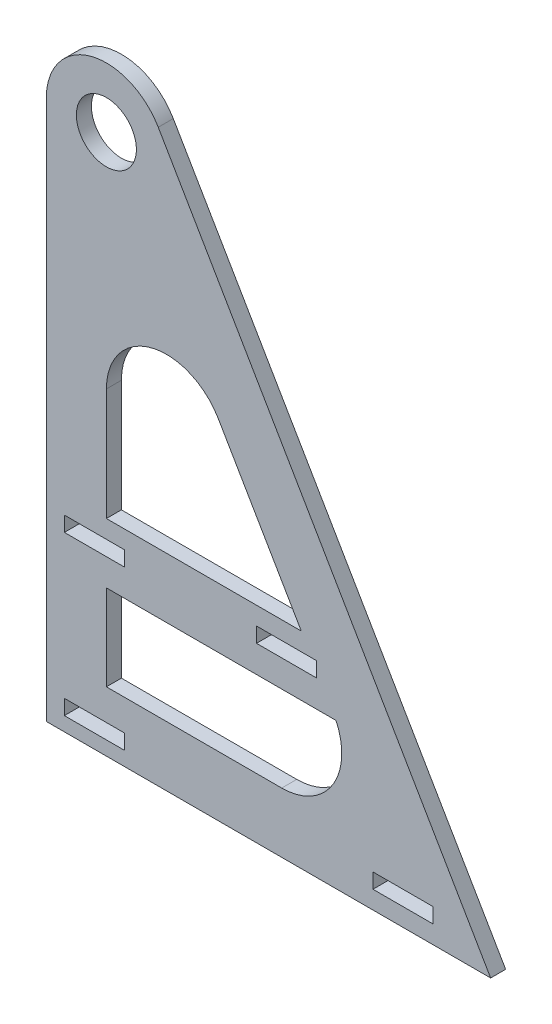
ISO-10303-21;
HEADER;
FILE_DESCRIPTION(('STEP AP214'),'2;1');
FILE_NAME('part.step','',(''),(''),'','','');
FILE_SCHEMA(('AUTOMOTIVE_DESIGN { 1 0 10303 214 1 1 1 1 }'));
ENDSEC;
DATA;
#1=APPLICATION_CONTEXT('core data for automotive mechanical design processes');
#2=APPLICATION_PROTOCOL_DEFINITION('international standard','automotive_design',2000,#1);
#3=PRODUCT_CONTEXT('',#1,'mechanical');
#4=PRODUCT('Part','Part','',(#3));
#5=PRODUCT_RELATED_PRODUCT_CATEGORY('part','',(#4));
#6=PRODUCT_DEFINITION_FORMATION('','',#4);
#7=PRODUCT_DEFINITION_CONTEXT('part definition',#1,'design');
#8=PRODUCT_DEFINITION('design','',#6,#7);
#9=PRODUCT_DEFINITION_SHAPE('','',#8);
#10=(LENGTH_UNIT() NAMED_UNIT(*) SI_UNIT(.MILLI.,.METRE.));
#11=(NAMED_UNIT(*) PLANE_ANGLE_UNIT() SI_UNIT($,.RADIAN.));
#12=(NAMED_UNIT(*) SI_UNIT($,.STERADIAN.) SOLID_ANGLE_UNIT());
#13=UNCERTAINTY_MEASURE_WITH_UNIT(LENGTH_MEASURE(1.E-05),#10,'distance_accuracy_value','');
#14=(GEOMETRIC_REPRESENTATION_CONTEXT(3) GLOBAL_UNCERTAINTY_ASSIGNED_CONTEXT((#13)) GLOBAL_UNIT_ASSIGNED_CONTEXT((#10,
#11,#12)) REPRESENTATION_CONTEXT('',''));
#15=CARTESIAN_POINT('',(0.,0.,0.));
#16=DIRECTION('',(0.,0.,1.));
#17=DIRECTION('',(1.,0.,0.));
#18=AXIS2_PLACEMENT_3D('',#15,#16,#17);
#19=CARTESIAN_POINT('',(0.,0.,12.5));
#20=DIRECTION('',(-1.,0.,0.));
#21=DIRECTION('',(0.,0.,1.));
#22=AXIS2_PLACEMENT_3D('',#19,#20,#21);
#23=PLANE('',#22);
#24=DIRECTION('',(0.,1.,0.));
#25=VECTOR('',#24,1.);
#26=CARTESIAN_POINT('',(0.,0.,0.));
#27=LINE('',#26,#25);
#28=CARTESIAN_POINT('',(0.,121.369897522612,0.));
#29=VERTEX_POINT('',#28);
#30=CARTESIAN_POINT('',(0.,214.831651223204,0.));
#31=VERTEX_POINT('',#30);
#32=EDGE_CURVE('E418',#29,#31,#27,.T.);
#33=ORIENTED_EDGE('',*,*,#32,.T.);
#34=DIRECTION('',(0.,0.,-1.));
#35=VECTOR('',#34,1.);
#36=CARTESIAN_POINT('',(0.,214.831651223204,12.5));
#37=LINE('',#36,#35);
#38=CARTESIAN_POINT('',(0.,214.831651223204,12.5));
#39=VERTEX_POINT('',#38);
#40=EDGE_CURVE('E11',#39,#31,#37,.T.);
#41=ORIENTED_EDGE('',*,*,#40,.F.);
#42=DIRECTION('',(0.,1.,0.));
#43=VECTOR('',#42,1.);
#44=CARTESIAN_POINT('',(0.,0.,12.5));
#45=LINE('',#44,#43);
#46=CARTESIAN_POINT('',(0.,121.369897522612,12.5));
#47=VERTEX_POINT('',#46);
#48=EDGE_CURVE('E381',#47,#39,#45,.T.);
#49=ORIENTED_EDGE('',*,*,#48,.F.);
#50=DIRECTION('',(0.,0.,-1.));
#51=VECTOR('',#50,1.);
#52=CARTESIAN_POINT('',(0.,121.369897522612,12.5));
#53=LINE('',#52,#51);
#54=EDGE_CURVE('E428',#47,#29,#53,.T.);
#55=ORIENTED_EDGE('',*,*,#54,.T.);
#56=EDGE_LOOP('',(#33,#41,#49,#55));
#57=FACE_BOUND('',#56,.T.);
#58=ADVANCED_FACE('F35',(#57),#23,.F.);
#59=CARTESIAN_POINT('',(50.,214.831651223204,12.5));
#60=DIRECTION('',(0.,0.,-1.));
#61=DIRECTION('',(-1.,0.,0.));
#62=AXIS2_PLACEMENT_3D('',#59,#60,#61);
#63=CYLINDRICAL_SURFACE('',#62,50.);
#64=CARTESIAN_POINT('',(50.,214.831651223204,0.));
#65=DIRECTION('',(0.,0.,1.));
#66=DIRECTION('',(1.,0.,0.));
#67=AXIS2_PLACEMENT_3D('',#64,#65,#66);
#68=CIRCLE('',#67,50.);
#69=CARTESIAN_POINT('',(93.2041796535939,239.999067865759,0.));
#70=VERTEX_POINT('',#69);
#71=EDGE_CURVE('E421',#31,#70,#68,.F.);
#72=ORIENTED_EDGE('',*,*,#71,.T.);
#73=DIRECTION('',(0.,0.,-1.));
#74=VECTOR('',#73,1.);
#75=CARTESIAN_POINT('',(93.2041796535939,239.999067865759,12.5));
#76=LINE('',#75,#74);
#77=CARTESIAN_POINT('',(93.2041796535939,239.999067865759,12.5));
#78=VERTEX_POINT('',#77);
#79=EDGE_CURVE('E44',#78,#70,#76,.T.);
#80=ORIENTED_EDGE('',*,*,#79,.F.);
#81=CARTESIAN_POINT('',(50.,214.831651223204,12.5));
#82=DIRECTION('',(0.,0.,1.));
#83=DIRECTION('',(1.,0.,0.));
#84=AXIS2_PLACEMENT_3D('',#81,#82,#83);
#85=CIRCLE('',#84,50.);
#86=EDGE_CURVE('E384',#39,#78,#85,.F.);
#87=ORIENTED_EDGE('',*,*,#86,.F.);
#88=ORIENTED_EDGE('',*,*,#40,.T.);
#89=EDGE_LOOP('',(#72,#80,#87,#88));
#90=FACE_BOUND('',#89,.T.);
#91=ADVANCED_FACE('F481',(#90),#63,.F.);
#92=CARTESIAN_POINT('',(173.974014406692,101.343817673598,12.5));
#93=DIRECTION('',(0.864083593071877,0.503348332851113,0.));
#94=DIRECTION('',(-0.503348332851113,0.864083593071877,0.));
#95=AXIS2_PLACEMENT_3D('',#92,#93,#94);
#96=PLANE('',#95);
#97=DIRECTION('',(0.503348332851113,-0.864083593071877,0.));
#98=VECTOR('',#97,1.);
#99=CARTESIAN_POINT('',(173.974014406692,101.343817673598,0.));
#100=LINE('',#99,#98);
#101=CARTESIAN_POINT('',(162.308367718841,121.369897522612,0.));
#102=VERTEX_POINT('',#101);
#103=EDGE_CURVE('E423',#70,#102,#100,.T.);
#104=ORIENTED_EDGE('',*,*,#103,.T.);
#105=DIRECTION('',(0.,0.,-1.));
#106=VECTOR('',#105,1.);
#107=CARTESIAN_POINT('',(162.308367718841,121.369897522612,12.5));
#108=LINE('',#107,#106);
#109=CARTESIAN_POINT('',(162.308367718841,121.369897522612,12.5));
#110=VERTEX_POINT('',#109);
#111=EDGE_CURVE('E430',#110,#102,#108,.T.);
#112=ORIENTED_EDGE('',*,*,#111,.F.);
#113=DIRECTION('',(0.503348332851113,-0.864083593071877,0.));
#114=VECTOR('',#113,1.);
#115=CARTESIAN_POINT('',(173.974014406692,101.343817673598,12.5));
#116=LINE('',#115,#114);
#117=EDGE_CURVE('E386',#78,#110,#116,.T.);
#118=ORIENTED_EDGE('',*,*,#117,.F.);
#119=ORIENTED_EDGE('',*,*,#79,.T.);
#120=EDGE_LOOP('',(#104,#112,#118,#119));
#121=FACE_BOUND('',#120,.T.);
#122=ADVANCED_FACE('F486',(#121),#96,.F.);
#123=CARTESIAN_POINT('',(0.,400.,12.5));
#124=DIRECTION('',(0.,0.,-1.));
#125=DIRECTION('',(-1.,0.,0.));
#126=AXIS2_PLACEMENT_3D('',#123,#124,#125);
#127=CYLINDRICAL_SURFACE('',#126,50.);
#128=CARTESIAN_POINT('',(0.,400.,0.));
#129=DIRECTION('',(0.,0.,1.));
#130=DIRECTION('',(1.,0.,0.));
#131=AXIS2_PLACEMENT_3D('',#128,#129,#130);
#132=CIRCLE('',#131,50.);
#133=CARTESIAN_POINT('',(-50.,400.,0.));
#134=VERTEX_POINT('',#133);
#135=CARTESIAN_POINT('',(43.2041796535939,425.167416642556,0.));
#136=VERTEX_POINT('',#135);
#137=EDGE_CURVE('E406',#134,#136,#132,.F.);
#138=ORIENTED_EDGE('',*,*,#137,.F.);
#139=DIRECTION('',(0.,0.,-1.));
#140=VECTOR('',#139,1.);
#141=CARTESIAN_POINT('',(-50.,400.,12.5));
#142=LINE('',#141,#140);
#143=CARTESIAN_POINT('',(-50.,400.,12.5));
#144=VERTEX_POINT('',#143);
#145=EDGE_CURVE('E431',#144,#134,#142,.T.);
#146=ORIENTED_EDGE('',*,*,#145,.F.);
#147=CARTESIAN_POINT('',(0.,400.,12.5));
#148=DIRECTION('',(0.,0.,1.));
#149=DIRECTION('',(1.,0.,0.));
#150=AXIS2_PLACEMENT_3D('',#147,#148,#149);
#151=CIRCLE('',#150,50.);
#152=CARTESIAN_POINT('',(43.2041796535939,425.167416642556,12.5));
#153=VERTEX_POINT('',#152);
#154=EDGE_CURVE('E370',#144,#153,#151,.F.);
#155=ORIENTED_EDGE('',*,*,#154,.T.);
#156=DIRECTION('',(0.,0.,-1.));
#157=VECTOR('',#156,1.);
#158=CARTESIAN_POINT('',(43.2041796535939,425.167416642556,12.5));
#159=LINE('',#158,#157);
#160=EDGE_CURVE('E435',#153,#136,#159,.T.);
#161=ORIENTED_EDGE('',*,*,#160,.T.);
#162=EDGE_LOOP('',(#138,#146,#155,#161));
#163=FACE_BOUND('',#162,.T.);
#164=ADVANCED_FACE('F521',(#163),#127,.T.);
#165=CARTESIAN_POINT('',(-49.9999999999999,0.,12.5));
#166=DIRECTION('',(1.,0.,0.));
#167=DIRECTION('',(0.,1.,0.));
#168=AXIS2_PLACEMENT_3D('',#165,#166,#167);
#169=PLANE('',#168);
#170=DIRECTION('',(0.,-1.,0.));
#171=VECTOR('',#170,1.);
#172=CARTESIAN_POINT('',(-49.9999999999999,0.,0.));
#173=LINE('',#172,#171);
#174=CARTESIAN_POINT('',(-49.9999999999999,-50.,0.));
#175=VERTEX_POINT('',#174);
#176=EDGE_CURVE('E409',#134,#175,#173,.T.);
#177=ORIENTED_EDGE('',*,*,#176,.T.);
#178=DIRECTION('',(0.,0.,-1.));
#179=VECTOR('',#178,1.);
#180=CARTESIAN_POINT('',(-49.9999999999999,-50.,12.5));
#181=LINE('',#180,#179);
#182=CARTESIAN_POINT('',(-49.9999999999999,-50.,12.5));
#183=VERTEX_POINT('',#182);
#184=EDGE_CURVE('E439',#183,#175,#181,.T.);
#185=ORIENTED_EDGE('',*,*,#184,.F.);
#186=DIRECTION('',(0.,-1.,0.));
#187=VECTOR('',#186,1.);
#188=CARTESIAN_POINT('',(-49.9999999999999,0.,12.5));
#189=LINE('',#188,#187);
#190=EDGE_CURVE('E373',#144,#183,#189,.T.);
#191=ORIENTED_EDGE('',*,*,#190,.F.);
#192=ORIENTED_EDGE('',*,*,#145,.T.);
#193=EDGE_LOOP('',(#177,#185,#191,#192));
#194=FACE_BOUND('',#193,.T.);
#195=ADVANCED_FACE('F517',(#194),#169,.F.);
#196=CARTESIAN_POINT('',(0.,-50.,12.5));
#197=DIRECTION('',(0.,1.,0.));
#198=DIRECTION('',(-1.,0.,0.));
#199=AXIS2_PLACEMENT_3D('',#196,#197,#198);
#200=PLANE('',#199);
#201=DIRECTION('',(1.,0.,0.));
#202=VECTOR('',#201,1.);
#203=CARTESIAN_POINT('',(0.,-50.,0.));
#204=LINE('',#203,#202);
#205=CARTESIAN_POINT('',(320.,-50.,0.));
#206=VERTEX_POINT('',#205);
#207=EDGE_CURVE('E412',#175,#206,#204,.T.);
#208=ORIENTED_EDGE('',*,*,#207,.T.);
#209=DIRECTION('',(0.,0.,-1.));
#210=VECTOR('',#209,1.);
#211=CARTESIAN_POINT('',(320.,-50.,12.5));
#212=LINE('',#211,#210);
#213=CARTESIAN_POINT('',(320.,-50.,12.5));
#214=VERTEX_POINT('',#213);
#215=EDGE_CURVE('E437',#214,#206,#212,.T.);
#216=ORIENTED_EDGE('',*,*,#215,.F.);
#217=DIRECTION('',(1.,0.,0.));
#218=VECTOR('',#217,1.);
#219=CARTESIAN_POINT('',(0.,-50.,12.5));
#220=LINE('',#219,#218);
#221=EDGE_CURVE('E376',#183,#214,#220,.T.);
#222=ORIENTED_EDGE('',*,*,#221,.F.);
#223=ORIENTED_EDGE('',*,*,#184,.T.);
#224=EDGE_LOOP('',(#208,#216,#222,#223));
#225=FACE_BOUND('',#224,.T.);
#226=ADVANCED_FACE('F514',(#225),#200,.F.);
#227=CARTESIAN_POINT('',(146.01818332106,50.,12.5));
#228=DIRECTION('',(0.,0.,-1.));
#229=DIRECTION('',(-1.,0.,0.));
#230=AXIS2_PLACEMENT_3D('',#227,#228,#229);
#231=CYLINDRICAL_SURFACE('',#230,50.);
#232=CARTESIAN_POINT('',(146.01818332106,50.,0.));
#233=DIRECTION('',(0.,0.,1.));
#234=DIRECTION('',(1.,0.,0.));
#235=AXIS2_PLACEMENT_3D('',#232,#233,#234);
#236=CIRCLE('',#235,50.);
#237=CARTESIAN_POINT('',(146.01818332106,0.,0.));
#238=VERTEX_POINT('',#237);
#239=CARTESIAN_POINT('',(191.22136329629,71.3698975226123,0.));
#240=VERTEX_POINT('',#239);
#241=EDGE_CURVE('E394',#238,#240,#236,.T.);
#242=ORIENTED_EDGE('',*,*,#241,.F.);
#243=DIRECTION('',(0.,0.,-1.));
#244=VECTOR('',#243,1.);
#245=CARTESIAN_POINT('',(146.01818332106,0.,12.5));
#246=LINE('',#245,#244);
#247=CARTESIAN_POINT('',(146.01818332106,0.,12.5));
#248=VERTEX_POINT('',#247);
#249=EDGE_CURVE('E39',#248,#238,#246,.T.);
#250=ORIENTED_EDGE('',*,*,#249,.F.);
#251=CARTESIAN_POINT('',(146.01818332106,50.,12.5));
#252=DIRECTION('',(0.,0.,1.));
#253=DIRECTION('',(1.,0.,0.));
#254=AXIS2_PLACEMENT_3D('',#251,#252,#253);
#255=CIRCLE('',#254,50.);
#256=CARTESIAN_POINT('',(191.22136329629,71.3698975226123,12.5));
#257=VERTEX_POINT('',#256);
#258=EDGE_CURVE('E358',#248,#257,#255,.T.);
#259=ORIENTED_EDGE('',*,*,#258,.T.);
#260=DIRECTION('',(0.,0.,-1.));
#261=VECTOR('',#260,1.);
#262=CARTESIAN_POINT('',(191.22136329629,71.3698975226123,12.5));
#263=LINE('',#262,#261);
#264=EDGE_CURVE('E391',#257,#240,#263,.T.);
#265=ORIENTED_EDGE('',*,*,#264,.T.);
#266=EDGE_LOOP('',(#242,#250,#259,#265));
#267=FACE_BOUND('',#266,.T.);
#268=ADVANCED_FACE('F457',(#267),#231,.F.);
#269=CARTESIAN_POINT('',(0.,0.,12.5));
#270=DIRECTION('',(0.,1.,0.));
#271=DIRECTION('',(0.,0.,1.));
#272=AXIS2_PLACEMENT_3D('',#269,#270,#271);
#273=PLANE('',#272);
#274=DIRECTION('',(1.,0.,0.));
#275=VECTOR('',#274,1.);
#276=CARTESIAN_POINT('',(0.,0.,0.));
#277=LINE('',#276,#275);
#278=CARTESIAN_POINT('',(0.,0.,0.));
#279=VERTEX_POINT('',#278);
#280=EDGE_CURVE('E397',#279,#238,#277,.T.);
#281=ORIENTED_EDGE('',*,*,#280,.F.);
#282=DIRECTION('',(0.,0.,-1.));
#283=VECTOR('',#282,1.);
#284=CARTESIAN_POINT('',(0.,0.,12.5));
#285=LINE('',#284,#283);
#286=CARTESIAN_POINT('',(0.,0.,12.5));
#287=VERTEX_POINT('',#286);
#288=EDGE_CURVE('E446',#287,#279,#285,.T.);
#289=ORIENTED_EDGE('',*,*,#288,.F.);
#290=DIRECTION('',(1.,0.,0.));
#291=VECTOR('',#290,1.);
#292=CARTESIAN_POINT('',(0.,0.,12.5));
#293=LINE('',#292,#291);
#294=EDGE_CURVE('E362',#287,#248,#293,.T.);
#295=ORIENTED_EDGE('',*,*,#294,.T.);
#296=ORIENTED_EDGE('',*,*,#249,.T.);
#297=EDGE_LOOP('',(#281,#289,#295,#296));
#298=FACE_BOUND('',#297,.T.);
#299=ADVANCED_FACE('F453',(#298),#273,.T.);
#300=CARTESIAN_POINT('',(0.,0.,12.5));
#301=DIRECTION('',(-1.,0.,0.));
#302=DIRECTION('',(0.,0.,1.));
#303=AXIS2_PLACEMENT_3D('',#300,#301,#302);
#304=PLANE('',#303);
#305=DIRECTION('',(0.,1.,0.));
#306=VECTOR('',#305,1.);
#307=CARTESIAN_POINT('',(0.,0.,0.));
#308=LINE('',#307,#306);
#309=CARTESIAN_POINT('',(0.,71.3698975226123,0.));
#310=VERTEX_POINT('',#309);
#311=EDGE_CURVE('E400',#279,#310,#308,.T.);
#312=ORIENTED_EDGE('',*,*,#311,.T.);
#313=DIRECTION('',(0.,0.,-1.));
#314=VECTOR('',#313,1.);
#315=CARTESIAN_POINT('',(0.,71.3698975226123,12.5));
#316=LINE('',#315,#314);
#317=CARTESIAN_POINT('',(0.,71.3698975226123,12.5));
#318=VERTEX_POINT('',#317);
#319=EDGE_CURVE('E444',#318,#310,#316,.T.);
#320=ORIENTED_EDGE('',*,*,#319,.F.);
#321=DIRECTION('',(0.,1.,0.));
#322=VECTOR('',#321,1.);
#323=CARTESIAN_POINT('',(0.,0.,12.5));
#324=LINE('',#323,#322);
#325=EDGE_CURVE('E365',#287,#318,#324,.T.);
#326=ORIENTED_EDGE('',*,*,#325,.F.);
#327=ORIENTED_EDGE('',*,*,#288,.T.);
#328=EDGE_LOOP('',(#312,#320,#326,#327));
#329=FACE_BOUND('',#328,.T.);
#330=ADVANCED_FACE('F463',(#329),#304,.F.);
#331=CARTESIAN_POINT('',(217.178194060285,126.511234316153,12.5));
#332=DIRECTION('',(0.864083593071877,0.503348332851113,0.));
#333=DIRECTION('',(-0.503348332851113,0.864083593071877,0.));
#334=AXIS2_PLACEMENT_3D('',#331,#332,#333);
#335=PLANE('',#334);
#336=DIRECTION('',(0.503348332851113,-0.864083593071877,0.));
#337=VECTOR('',#336,1.);
#338=CARTESIAN_POINT('',(217.178194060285,126.511234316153,0.));
#339=LINE('',#338,#337);
#340=EDGE_CURVE('E415',#136,#206,#339,.T.);
#341=ORIENTED_EDGE('',*,*,#340,.F.);
#342=ORIENTED_EDGE('',*,*,#160,.F.);
#343=DIRECTION('',(0.503348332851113,-0.864083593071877,0.));
#344=VECTOR('',#343,1.);
#345=CARTESIAN_POINT('',(217.178194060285,126.511234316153,12.5));
#346=LINE('',#345,#344);
#347=EDGE_CURVE('E378',#153,#214,#346,.T.);
#348=ORIENTED_EDGE('',*,*,#347,.T.);
#349=ORIENTED_EDGE('',*,*,#215,.T.);
#350=EDGE_LOOP('',(#341,#342,#348,#349));
#351=FACE_BOUND('',#350,.T.);
#352=ADVANCED_FACE('F510',(#351),#335,.T.);
#353=CARTESIAN_POINT('',(0.,71.3698975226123,12.5));
#354=DIRECTION('',(0.,1.,0.));
#355=DIRECTION('',(0.,0.,1.));
#356=AXIS2_PLACEMENT_3D('',#353,#354,#355);
#357=PLANE('',#356);
#358=DIRECTION('',(1.,0.,0.));
#359=VECTOR('',#358,1.);
#360=CARTESIAN_POINT('',(0.,71.3698975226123,0.));
#361=LINE('',#360,#359);
#362=EDGE_CURVE('E403',#310,#240,#361,.T.);
#363=ORIENTED_EDGE('',*,*,#362,.T.);
#364=ORIENTED_EDGE('',*,*,#264,.F.);
#365=DIRECTION('',(1.,0.,0.));
#366=VECTOR('',#365,1.);
#367=CARTESIAN_POINT('',(0.,71.3698975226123,12.5));
#368=LINE('',#367,#366);
#369=EDGE_CURVE('E368',#318,#257,#368,.T.);
#370=ORIENTED_EDGE('',*,*,#369,.F.);
#371=ORIENTED_EDGE('',*,*,#319,.T.);
#372=EDGE_LOOP('',(#363,#364,#370,#371));
#373=FACE_BOUND('',#372,.T.);
#374=ADVANCED_FACE('F465',(#373),#357,.F.);
#375=CARTESIAN_POINT('',(0.,400.,12.5));
#376=DIRECTION('',(0.,0.,-1.));
#377=DIRECTION('',(-1.,0.,0.));
#378=AXIS2_PLACEMENT_3D('',#375,#376,#377);
#379=CYLINDRICAL_SURFACE('',#378,25.);
#380=CARTESIAN_POINT('',(0.,400.,12.5));
#381=DIRECTION('',(0.,0.,1.));
#382=DIRECTION('',(1.,0.,0.));
#383=AXIS2_PLACEMENT_3D('',#380,#381,#382);
#384=CIRCLE('',#383,25.);
#385=CARTESIAN_POINT('',(25.,400.,12.5));
#386=VERTEX_POINT('',#385);
#387=EDGE_CURVE('E355',#386,#386,#384,.T.);
#388=ORIENTED_EDGE('',*,*,#387,.T.);
#389=EDGE_LOOP('',(#388));
#390=FACE_BOUND('',#389,.T.);
#391=CARTESIAN_POINT('',(0.,400.,0.));
#392=DIRECTION('',(0.,0.,1.));
#393=DIRECTION('',(1.,0.,0.));
#394=AXIS2_PLACEMENT_3D('',#391,#392,#393);
#395=CIRCLE('',#394,25.);
#396=CARTESIAN_POINT('',(25.,400.,0.));
#397=VERTEX_POINT('',#396);
#398=EDGE_CURVE('E348',#397,#397,#395,.T.);
#399=ORIENTED_EDGE('',*,*,#398,.F.);
#400=EDGE_LOOP('',(#399));
#401=FACE_BOUND('',#400,.T.);
#402=ADVANCED_FACE('F37',(#390,#401),#379,.F.);
#403=CARTESIAN_POINT('',(0.,121.369897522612,12.5));
#404=DIRECTION('',(0.,1.,0.));
#405=DIRECTION('',(0.,0.,1.));
#406=AXIS2_PLACEMENT_3D('',#403,#404,#405);
#407=PLANE('',#406);
#408=DIRECTION('',(1.,0.,0.));
#409=VECTOR('',#408,1.);
#410=CARTESIAN_POINT('',(0.,121.369897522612,0.));
#411=LINE('',#410,#409);
#412=EDGE_CURVE('E359',#29,#102,#411,.T.);
#413=ORIENTED_EDGE('',*,*,#412,.F.);
#414=ORIENTED_EDGE('',*,*,#54,.F.);
#415=DIRECTION('',(1.,0.,0.));
#416=VECTOR('',#415,1.);
#417=CARTESIAN_POINT('',(0.,121.369897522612,12.5));
#418=LINE('',#417,#416);
#419=EDGE_CURVE('E388',#47,#110,#418,.T.);
#420=ORIENTED_EDGE('',*,*,#419,.T.);
#421=ORIENTED_EDGE('',*,*,#111,.T.);
#422=EDGE_LOOP('',(#413,#414,#420,#421));
#423=FACE_BOUND('',#422,.T.);
#424=ADVANCED_FACE('F469',(#423),#407,.T.);
#425=CARTESIAN_POINT('',(0.,0.,12.5));
#426=DIRECTION('',(0.,0.,1.));
#427=DIRECTION('',(1.,0.,0.));
#428=AXIS2_PLACEMENT_3D('',#425,#426,#427);
#429=PLANE('',#428);
#430=DIRECTION('',(0.,1.,0.));
#431=VECTOR('',#430,1.);
#432=CARTESIAN_POINT('',(-35.,-25.7737408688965,12.5));
#433=LINE('',#432,#431);
#434=CARTESIAN_POINT('',(-35.,-38.2737408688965,12.5));
#435=VERTEX_POINT('',#434);
#436=CARTESIAN_POINT('',(-35.,-25.7737408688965,12.5));
#437=VERTEX_POINT('',#436);
#438=EDGE_CURVE('E224',#435,#437,#433,.T.);
#439=ORIENTED_EDGE('',*,*,#438,.T.);
#440=DIRECTION('',(1.,0.,0.));
#441=VECTOR('',#440,1.);
#442=CARTESIAN_POINT('',(-35.,-25.7737408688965,12.5));
#443=LINE('',#442,#441);
#444=CARTESIAN_POINT('',(15.,-25.7737408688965,12.5));
#445=VERTEX_POINT('',#444);
#446=EDGE_CURVE('E233',#437,#445,#443,.T.);
#447=ORIENTED_EDGE('',*,*,#446,.T.);
#448=DIRECTION('',(0.,-1.,0.));
#449=VECTOR('',#448,1.);
#450=CARTESIAN_POINT('',(15.,-25.7737408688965,12.5));
#451=LINE('',#450,#449);
#452=CARTESIAN_POINT('',(15.,-38.2737408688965,12.5));
#453=VERTEX_POINT('',#452);
#454=EDGE_CURVE('E52',#445,#453,#451,.T.);
#455=ORIENTED_EDGE('',*,*,#454,.T.);
#456=DIRECTION('',(-1.,0.,0.));
#457=VECTOR('',#456,1.);
#458=CARTESIAN_POINT('',(-35.,-38.2737408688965,12.5));
#459=LINE('',#458,#457);
#460=EDGE_CURVE('E230',#453,#435,#459,.T.);
#461=ORIENTED_EDGE('',*,*,#460,.T.);
#462=EDGE_LOOP('',(#439,#447,#455,#461));
#463=FACE_BOUND('',#462,.T.);
#464=DIRECTION('',(0.,-1.,0.));
#465=VECTOR('',#464,1.);
#466=CARTESIAN_POINT('',(272.,-22.5,12.5));
#467=LINE('',#466,#465);
#468=CARTESIAN_POINT('',(272.,-22.5,12.5));
#469=VERTEX_POINT('',#468);
#470=CARTESIAN_POINT('',(272.,-35.,12.5));
#471=VERTEX_POINT('',#470);
#472=EDGE_CURVE('E259',#469,#471,#467,.T.);
#473=ORIENTED_EDGE('',*,*,#472,.T.);
#474=DIRECTION('',(-1.,0.,0.));
#475=VECTOR('',#474,1.);
#476=CARTESIAN_POINT('',(272.,-35.,12.5));
#477=LINE('',#476,#475);
#478=CARTESIAN_POINT('',(222.,-35.,12.5));
#479=VERTEX_POINT('',#478);
#480=EDGE_CURVE('E262',#471,#479,#477,.T.);
#481=ORIENTED_EDGE('',*,*,#480,.T.);
#482=DIRECTION('',(0.,1.,0.));
#483=VECTOR('',#482,1.);
#484=CARTESIAN_POINT('',(222.,-22.5,12.5));
#485=LINE('',#484,#483);
#486=CARTESIAN_POINT('',(222.,-22.5,12.5));
#487=VERTEX_POINT('',#486);
#488=EDGE_CURVE('E266',#479,#487,#485,.T.);
#489=ORIENTED_EDGE('',*,*,#488,.T.);
#490=DIRECTION('',(1.,0.,0.));
#491=VECTOR('',#490,1.);
#492=CARTESIAN_POINT('',(272.,-22.5,12.5));
#493=LINE('',#492,#491);
#494=EDGE_CURVE('E269',#487,#469,#493,.T.);
#495=ORIENTED_EDGE('',*,*,#494,.T.);
#496=EDGE_LOOP('',(#473,#481,#489,#495));
#497=FACE_BOUND('',#496,.T.);
#498=DIRECTION('',(0.,1.,0.));
#499=VECTOR('',#498,1.);
#500=CARTESIAN_POINT('',(15.,106.369897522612,12.5));
#501=LINE('',#500,#499);
#502=CARTESIAN_POINT('',(15.,93.8698975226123,12.5));
#503=VERTEX_POINT('',#502);
#504=CARTESIAN_POINT('',(15.,106.369897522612,12.5));
#505=VERTEX_POINT('',#504);
#506=EDGE_CURVE('E284',#503,#505,#501,.T.);
#507=ORIENTED_EDGE('',*,*,#506,.F.);
#508=DIRECTION('',(1.,0.,0.));
#509=VECTOR('',#508,1.);
#510=CARTESIAN_POINT('',(15.,93.8698975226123,12.5));
#511=LINE('',#510,#509);
#512=CARTESIAN_POINT('',(-35.,93.8698975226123,12.5));
#513=VERTEX_POINT('',#512);
#514=EDGE_CURVE('E295',#513,#503,#511,.T.);
#515=ORIENTED_EDGE('',*,*,#514,.F.);
#516=DIRECTION('',(0.,-1.,0.));
#517=VECTOR('',#516,1.);
#518=CARTESIAN_POINT('',(-35.,106.369897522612,12.5));
#519=LINE('',#518,#517);
#520=CARTESIAN_POINT('',(-35.,106.369897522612,12.5));
#521=VERTEX_POINT('',#520);
#522=EDGE_CURVE('E309',#521,#513,#519,.T.);
#523=ORIENTED_EDGE('',*,*,#522,.F.);
#524=DIRECTION('',(-1.,0.,0.));
#525=VECTOR('',#524,1.);
#526=CARTESIAN_POINT('',(15.,106.369897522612,12.5));
#527=LINE('',#526,#525);
#528=EDGE_CURVE('E306',#505,#521,#527,.T.);
#529=ORIENTED_EDGE('',*,*,#528,.F.);
#530=EDGE_LOOP('',(#507,#515,#523,#529));
#531=FACE_BOUND('',#530,.T.);
#532=DIRECTION('',(0.,1.,0.));
#533=VECTOR('',#532,1.);
#534=CARTESIAN_POINT('',(175.,106.369897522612,12.5));
#535=LINE('',#534,#533);
#536=CARTESIAN_POINT('',(175.,93.8698975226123,12.5));
#537=VERTEX_POINT('',#536);
#538=CARTESIAN_POINT('',(175.,106.369897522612,12.5));
#539=VERTEX_POINT('',#538);
#540=EDGE_CURVE('E316',#537,#539,#535,.T.);
#541=ORIENTED_EDGE('',*,*,#540,.F.);
#542=DIRECTION('',(1.,0.,0.));
#543=VECTOR('',#542,1.);
#544=CARTESIAN_POINT('',(175.,93.8698975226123,12.5));
#545=LINE('',#544,#543);
#546=CARTESIAN_POINT('',(125.,93.8698975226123,12.5));
#547=VERTEX_POINT('',#546);
#548=EDGE_CURVE('E327',#547,#537,#545,.T.);
#549=ORIENTED_EDGE('',*,*,#548,.F.);
#550=DIRECTION('',(0.,-1.,0.));
#551=VECTOR('',#550,1.);
#552=CARTESIAN_POINT('',(125.,106.369897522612,12.5));
#553=LINE('',#552,#551);
#554=CARTESIAN_POINT('',(125.,106.369897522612,12.5));
#555=VERTEX_POINT('',#554);
#556=EDGE_CURVE('E341',#555,#547,#553,.T.);
#557=ORIENTED_EDGE('',*,*,#556,.F.);
#558=DIRECTION('',(-1.,0.,0.));
#559=VECTOR('',#558,1.);
#560=CARTESIAN_POINT('',(175.,106.369897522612,12.5));
#561=LINE('',#560,#559);
#562=EDGE_CURVE('E338',#539,#555,#561,.T.);
#563=ORIENTED_EDGE('',*,*,#562,.F.);
#564=EDGE_LOOP('',(#541,#549,#557,#563));
#565=FACE_BOUND('',#564,.T.);
#566=ORIENTED_EDGE('',*,*,#387,.F.);
#567=EDGE_LOOP('',(#566));
#568=FACE_BOUND('',#567,.T.);
#569=ORIENTED_EDGE('',*,*,#258,.F.);
#570=ORIENTED_EDGE('',*,*,#294,.F.);
#571=ORIENTED_EDGE('',*,*,#325,.T.);
#572=ORIENTED_EDGE('',*,*,#369,.T.);
#573=EDGE_LOOP('',(#569,#570,#571,#572));
#574=FACE_BOUND('',#573,.T.);
#575=ORIENTED_EDGE('',*,*,#154,.F.);
#576=ORIENTED_EDGE('',*,*,#190,.T.);
#577=ORIENTED_EDGE('',*,*,#221,.T.);
#578=ORIENTED_EDGE('',*,*,#347,.F.);
#579=EDGE_LOOP('',(#575,#576,#577,#578));
#580=FACE_BOUND('',#579,.T.);
#581=ORIENTED_EDGE('',*,*,#48,.T.);
#582=ORIENTED_EDGE('',*,*,#86,.T.);
#583=ORIENTED_EDGE('',*,*,#117,.T.);
#584=ORIENTED_EDGE('',*,*,#419,.F.);
#585=EDGE_LOOP('',(#581,#582,#583,#584));
#586=FACE_BOUND('',#585,.T.);
#587=ADVANCED_FACE('F237',(#463,#497,#531,#565,#568,#574,#580,#586),#429,.T.);
#588=CARTESIAN_POINT('',(0.,0.,0.));
#589=DIRECTION('',(0.,0.,1.));
#590=DIRECTION('',(1.,0.,0.));
#591=AXIS2_PLACEMENT_3D('',#588,#589,#590);
#592=PLANE('',#591);
#593=DIRECTION('',(1.,0.,0.));
#594=VECTOR('',#593,1.);
#595=CARTESIAN_POINT('',(-35.,-25.7737408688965,0.));
#596=LINE('',#595,#594);
#597=CARTESIAN_POINT('',(-35.,-25.7737408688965,0.));
#598=VERTEX_POINT('',#597);
#599=CARTESIAN_POINT('',(15.,-25.7737408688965,0.));
#600=VERTEX_POINT('',#599);
#601=EDGE_CURVE('E249',#598,#600,#596,.T.);
#602=ORIENTED_EDGE('',*,*,#601,.F.);
#603=DIRECTION('',(0.,1.,0.));
#604=VECTOR('',#603,1.);
#605=CARTESIAN_POINT('',(-35.,-25.7737408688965,0.));
#606=LINE('',#605,#604);
#607=CARTESIAN_POINT('',(-35.,-38.2737408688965,0.));
#608=VERTEX_POINT('',#607);
#609=EDGE_CURVE('E60',#608,#598,#606,.T.);
#610=ORIENTED_EDGE('',*,*,#609,.F.);
#611=DIRECTION('',(-1.,0.,0.));
#612=VECTOR('',#611,1.);
#613=CARTESIAN_POINT('',(-35.,-38.2737408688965,0.));
#614=LINE('',#613,#612);
#615=CARTESIAN_POINT('',(15.,-38.2737408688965,0.));
#616=VERTEX_POINT('',#615);
#617=EDGE_CURVE('E240',#616,#608,#614,.T.);
#618=ORIENTED_EDGE('',*,*,#617,.F.);
#619=DIRECTION('',(0.,-1.,0.));
#620=VECTOR('',#619,1.);
#621=CARTESIAN_POINT('',(15.,-25.7737408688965,0.));
#622=LINE('',#621,#620);
#623=EDGE_CURVE('E243',#600,#616,#622,.T.);
#624=ORIENTED_EDGE('',*,*,#623,.F.);
#625=EDGE_LOOP('',(#602,#610,#618,#624));
#626=FACE_BOUND('',#625,.T.);
#627=DIRECTION('',(-1.,0.,0.));
#628=VECTOR('',#627,1.);
#629=CARTESIAN_POINT('',(272.,-35.,0.));
#630=LINE('',#629,#628);
#631=CARTESIAN_POINT('',(272.,-35.,0.));
#632=VERTEX_POINT('',#631);
#633=CARTESIAN_POINT('',(222.,-35.,0.));
#634=VERTEX_POINT('',#633);
#635=EDGE_CURVE('E274',#632,#634,#630,.T.);
#636=ORIENTED_EDGE('',*,*,#635,.F.);
#637=DIRECTION('',(0.,-1.,0.));
#638=VECTOR('',#637,1.);
#639=CARTESIAN_POINT('',(272.,-22.5,0.));
#640=LINE('',#639,#638);
#641=CARTESIAN_POINT('',(272.,-22.5,0.));
#642=VERTEX_POINT('',#641);
#643=EDGE_CURVE('E255',#642,#632,#640,.T.);
#644=ORIENTED_EDGE('',*,*,#643,.F.);
#645=DIRECTION('',(1.,0.,0.));
#646=VECTOR('',#645,1.);
#647=CARTESIAN_POINT('',(272.,-22.5,0.));
#648=LINE('',#647,#646);
#649=CARTESIAN_POINT('',(222.,-22.5,0.));
#650=VERTEX_POINT('',#649);
#651=EDGE_CURVE('E263',#650,#642,#648,.T.);
#652=ORIENTED_EDGE('',*,*,#651,.F.);
#653=DIRECTION('',(0.,1.,0.));
#654=VECTOR('',#653,1.);
#655=CARTESIAN_POINT('',(222.,-22.5,0.));
#656=LINE('',#655,#654);
#657=EDGE_CURVE('E277',#634,#650,#656,.T.);
#658=ORIENTED_EDGE('',*,*,#657,.F.);
#659=EDGE_LOOP('',(#636,#644,#652,#658));
#660=FACE_BOUND('',#659,.T.);
#661=DIRECTION('',(1.,0.,0.));
#662=VECTOR('',#661,1.);
#663=CARTESIAN_POINT('',(15.,93.8698975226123,0.));
#664=LINE('',#663,#662);
#665=CARTESIAN_POINT('',(-35.,93.8698975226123,0.));
#666=VERTEX_POINT('',#665);
#667=CARTESIAN_POINT('',(15.,93.8698975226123,0.));
#668=VERTEX_POINT('',#667);
#669=EDGE_CURVE('E301',#666,#668,#664,.T.);
#670=ORIENTED_EDGE('',*,*,#669,.T.);
#671=DIRECTION('',(0.,1.,0.));
#672=VECTOR('',#671,1.);
#673=CARTESIAN_POINT('',(15.,106.369897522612,0.));
#674=LINE('',#673,#672);
#675=CARTESIAN_POINT('',(15.,106.369897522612,0.));
#676=VERTEX_POINT('',#675);
#677=EDGE_CURVE('E291',#668,#676,#674,.T.);
#678=ORIENTED_EDGE('',*,*,#677,.T.);
#679=DIRECTION('',(-1.,0.,0.));
#680=VECTOR('',#679,1.);
#681=CARTESIAN_POINT('',(15.,106.369897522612,0.));
#682=LINE('',#681,#680);
#683=CARTESIAN_POINT('',(-35.,106.369897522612,0.));
#684=VERTEX_POINT('',#683);
#685=EDGE_CURVE('E294',#676,#684,#682,.T.);
#686=ORIENTED_EDGE('',*,*,#685,.T.);
#687=DIRECTION('',(0.,-1.,0.));
#688=VECTOR('',#687,1.);
#689=CARTESIAN_POINT('',(-35.,106.369897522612,0.));
#690=LINE('',#689,#688);
#691=EDGE_CURVE('E298',#684,#666,#690,.T.);
#692=ORIENTED_EDGE('',*,*,#691,.T.);
#693=EDGE_LOOP('',(#670,#678,#686,#692));
#694=FACE_BOUND('',#693,.T.);
#695=DIRECTION('',(1.,0.,0.));
#696=VECTOR('',#695,1.);
#697=CARTESIAN_POINT('',(175.,93.8698975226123,0.));
#698=LINE('',#697,#696);
#699=CARTESIAN_POINT('',(125.,93.8698975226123,0.));
#700=VERTEX_POINT('',#699);
#701=CARTESIAN_POINT('',(175.,93.8698975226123,0.));
#702=VERTEX_POINT('',#701);
#703=EDGE_CURVE('E333',#700,#702,#698,.T.);
#704=ORIENTED_EDGE('',*,*,#703,.T.);
#705=DIRECTION('',(0.,1.,0.));
#706=VECTOR('',#705,1.);
#707=CARTESIAN_POINT('',(175.,106.369897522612,0.));
#708=LINE('',#707,#706);
#709=CARTESIAN_POINT('',(175.,106.369897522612,0.));
#710=VERTEX_POINT('',#709);
#711=EDGE_CURVE('E323',#702,#710,#708,.T.);
#712=ORIENTED_EDGE('',*,*,#711,.T.);
#713=DIRECTION('',(-1.,0.,0.));
#714=VECTOR('',#713,1.);
#715=CARTESIAN_POINT('',(175.,106.369897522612,0.));
#716=LINE('',#715,#714);
#717=CARTESIAN_POINT('',(125.,106.369897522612,0.));
#718=VERTEX_POINT('',#717);
#719=EDGE_CURVE('E326',#710,#718,#716,.T.);
#720=ORIENTED_EDGE('',*,*,#719,.T.);
#721=DIRECTION('',(0.,-1.,0.));
#722=VECTOR('',#721,1.);
#723=CARTESIAN_POINT('',(125.,106.369897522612,0.));
#724=LINE('',#723,#722);
#725=EDGE_CURVE('E330',#718,#700,#724,.T.);
#726=ORIENTED_EDGE('',*,*,#725,.T.);
#727=EDGE_LOOP('',(#704,#712,#720,#726));
#728=FACE_BOUND('',#727,.T.);
#729=ORIENTED_EDGE('',*,*,#398,.T.);
#730=EDGE_LOOP('',(#729));
#731=FACE_BOUND('',#730,.T.);
#732=ORIENTED_EDGE('',*,*,#241,.T.);
#733=ORIENTED_EDGE('',*,*,#362,.F.);
#734=ORIENTED_EDGE('',*,*,#311,.F.);
#735=ORIENTED_EDGE('',*,*,#280,.T.);
#736=EDGE_LOOP('',(#732,#733,#734,#735));
#737=FACE_BOUND('',#736,.T.);
#738=ORIENTED_EDGE('',*,*,#137,.T.);
#739=ORIENTED_EDGE('',*,*,#340,.T.);
#740=ORIENTED_EDGE('',*,*,#207,.F.);
#741=ORIENTED_EDGE('',*,*,#176,.F.);
#742=EDGE_LOOP('',(#738,#739,#740,#741));
#743=FACE_BOUND('',#742,.T.);
#744=ORIENTED_EDGE('',*,*,#32,.F.);
#745=ORIENTED_EDGE('',*,*,#412,.T.);
#746=ORIENTED_EDGE('',*,*,#103,.F.);
#747=ORIENTED_EDGE('',*,*,#71,.F.);
#748=EDGE_LOOP('',(#744,#745,#746,#747));
#749=FACE_BOUND('',#748,.T.);
#750=ADVANCED_FACE('F460',(#626,#660,#694,#728,#731,#737,#743,#749),#592,.F.);
#751=CARTESIAN_POINT('',(175.,106.369897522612,0.));
#752=DIRECTION('',(1.,0.,0.));
#753=DIRECTION('',(0.,0.,-1.));
#754=AXIS2_PLACEMENT_3D('',#751,#752,#753);
#755=PLANE('',#754);
#756=ORIENTED_EDGE('',*,*,#540,.T.);
#757=DIRECTION('',(0.,0.,1.));
#758=VECTOR('',#757,1.);
#759=CARTESIAN_POINT('',(175.,106.369897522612,0.));
#760=LINE('',#759,#758);
#761=EDGE_CURVE('E336',#710,#539,#760,.T.);
#762=ORIENTED_EDGE('',*,*,#761,.F.);
#763=ORIENTED_EDGE('',*,*,#711,.F.);
#764=DIRECTION('',(0.,0.,1.));
#765=VECTOR('',#764,1.);
#766=CARTESIAN_POINT('',(175.,93.8698975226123,0.));
#767=LINE('',#766,#765);
#768=EDGE_CURVE('E346',#702,#537,#767,.T.);
#769=ORIENTED_EDGE('',*,*,#768,.T.);
#770=EDGE_LOOP('',(#756,#762,#763,#769));
#771=FACE_BOUND('',#770,.T.);
#772=ADVANCED_FACE('F491',(#771),#755,.F.);
#773=CARTESIAN_POINT('',(175.,93.8698975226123,0.));
#774=DIRECTION('',(0.,-1.,0.));
#775=DIRECTION('',(0.,0.,-1.));
#776=AXIS2_PLACEMENT_3D('',#773,#774,#775);
#777=PLANE('',#776);
#778=ORIENTED_EDGE('',*,*,#548,.T.);
#779=ORIENTED_EDGE('',*,*,#768,.F.);
#780=ORIENTED_EDGE('',*,*,#703,.F.);
#781=DIRECTION('',(0.,0.,1.));
#782=VECTOR('',#781,1.);
#783=CARTESIAN_POINT('',(125.,93.8698975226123,0.));
#784=LINE('',#783,#782);
#785=EDGE_CURVE('E349',#700,#547,#784,.T.);
#786=ORIENTED_EDGE('',*,*,#785,.T.);
#787=EDGE_LOOP('',(#778,#779,#780,#786));
#788=FACE_BOUND('',#787,.T.);
#789=ADVANCED_FACE('F497',(#788),#777,.F.);
#790=CARTESIAN_POINT('',(125.,106.369897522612,0.));
#791=DIRECTION('',(-1.,0.,0.));
#792=DIRECTION('',(0.,-1.,0.));
#793=AXIS2_PLACEMENT_3D('',#790,#791,#792);
#794=PLANE('',#793);
#795=ORIENTED_EDGE('',*,*,#556,.T.);
#796=ORIENTED_EDGE('',*,*,#785,.F.);
#797=ORIENTED_EDGE('',*,*,#725,.F.);
#798=DIRECTION('',(0.,0.,1.));
#799=VECTOR('',#798,1.);
#800=CARTESIAN_POINT('',(125.,106.369897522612,0.));
#801=LINE('',#800,#799);
#802=EDGE_CURVE('E351',#718,#555,#801,.T.);
#803=ORIENTED_EDGE('',*,*,#802,.T.);
#804=EDGE_LOOP('',(#795,#796,#797,#803));
#805=FACE_BOUND('',#804,.T.);
#806=ADVANCED_FACE('F652',(#805),#794,.F.);
#807=CARTESIAN_POINT('',(175.,106.369897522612,0.));
#808=DIRECTION('',(0.,1.,0.));
#809=DIRECTION('',(0.,0.,1.));
#810=AXIS2_PLACEMENT_3D('',#807,#808,#809);
#811=PLANE('',#810);
#812=ORIENTED_EDGE('',*,*,#562,.T.);
#813=ORIENTED_EDGE('',*,*,#802,.F.);
#814=ORIENTED_EDGE('',*,*,#719,.F.);
#815=ORIENTED_EDGE('',*,*,#761,.T.);
#816=EDGE_LOOP('',(#812,#813,#814,#815));
#817=FACE_BOUND('',#816,.T.);
#818=ADVANCED_FACE('F648',(#817),#811,.F.);
#819=CARTESIAN_POINT('',(15.,106.369897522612,0.));
#820=DIRECTION('',(1.,0.,0.));
#821=DIRECTION('',(0.,1.,0.));
#822=AXIS2_PLACEMENT_3D('',#819,#820,#821);
#823=PLANE('',#822);
#824=ORIENTED_EDGE('',*,*,#506,.T.);
#825=DIRECTION('',(0.,0.,1.));
#826=VECTOR('',#825,1.);
#827=CARTESIAN_POINT('',(15.,106.369897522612,0.));
#828=LINE('',#827,#826);
#829=EDGE_CURVE('E304',#676,#505,#828,.T.);
#830=ORIENTED_EDGE('',*,*,#829,.F.);
#831=ORIENTED_EDGE('',*,*,#677,.F.);
#832=DIRECTION('',(0.,0.,1.));
#833=VECTOR('',#832,1.);
#834=CARTESIAN_POINT('',(15.,93.8698975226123,0.));
#835=LINE('',#834,#833);
#836=EDGE_CURVE('E314',#668,#503,#835,.T.);
#837=ORIENTED_EDGE('',*,*,#836,.T.);
#838=EDGE_LOOP('',(#824,#830,#831,#837));
#839=FACE_BOUND('',#838,.T.);
#840=ADVANCED_FACE('F638',(#839),#823,.F.);
#841=CARTESIAN_POINT('',(15.,93.8698975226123,0.));
#842=DIRECTION('',(0.,-1.,0.));
#843=DIRECTION('',(0.,0.,-1.));
#844=AXIS2_PLACEMENT_3D('',#841,#842,#843);
#845=PLANE('',#844);
#846=ORIENTED_EDGE('',*,*,#514,.T.);
#847=ORIENTED_EDGE('',*,*,#836,.F.);
#848=ORIENTED_EDGE('',*,*,#669,.F.);
#849=DIRECTION('',(0.,0.,1.));
#850=VECTOR('',#849,1.);
#851=CARTESIAN_POINT('',(-35.,93.8698975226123,0.));
#852=LINE('',#851,#850);
#853=EDGE_CURVE('E317',#666,#513,#852,.T.);
#854=ORIENTED_EDGE('',*,*,#853,.T.);
#855=EDGE_LOOP('',(#846,#847,#848,#854));
#856=FACE_BOUND('',#855,.T.);
#857=ADVANCED_FACE('F634',(#856),#845,.F.);
#858=CARTESIAN_POINT('',(-35.,106.369897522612,0.));
#859=DIRECTION('',(-1.,0.,0.));
#860=DIRECTION('',(0.,0.,1.));
#861=AXIS2_PLACEMENT_3D('',#858,#859,#860);
#862=PLANE('',#861);
#863=ORIENTED_EDGE('',*,*,#522,.T.);
#864=ORIENTED_EDGE('',*,*,#853,.F.);
#865=ORIENTED_EDGE('',*,*,#691,.F.);
#866=DIRECTION('',(0.,0.,1.));
#867=VECTOR('',#866,1.);
#868=CARTESIAN_POINT('',(-35.,106.369897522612,0.));
#869=LINE('',#868,#867);
#870=EDGE_CURVE('E319',#684,#521,#869,.T.);
#871=ORIENTED_EDGE('',*,*,#870,.T.);
#872=EDGE_LOOP('',(#863,#864,#865,#871));
#873=FACE_BOUND('',#872,.T.);
#874=ADVANCED_FACE('F637',(#873),#862,.F.);
#875=CARTESIAN_POINT('',(15.,106.369897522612,0.));
#876=DIRECTION('',(0.,1.,0.));
#877=DIRECTION('',(0.,0.,1.));
#878=AXIS2_PLACEMENT_3D('',#875,#876,#877);
#879=PLANE('',#878);
#880=ORIENTED_EDGE('',*,*,#528,.T.);
#881=ORIENTED_EDGE('',*,*,#870,.F.);
#882=ORIENTED_EDGE('',*,*,#685,.F.);
#883=ORIENTED_EDGE('',*,*,#829,.T.);
#884=EDGE_LOOP('',(#880,#881,#882,#883));
#885=FACE_BOUND('',#884,.T.);
#886=ADVANCED_FACE('F632',(#885),#879,.F.);
#887=CARTESIAN_POINT('',(272.,-22.5,12.5));
#888=DIRECTION('',(1.,0.,0.));
#889=DIRECTION('',(0.,0.,-1.));
#890=AXIS2_PLACEMENT_3D('',#887,#888,#889);
#891=PLANE('',#890);
#892=ORIENTED_EDGE('',*,*,#643,.T.);
#893=DIRECTION('',(0.,0.,-1.));
#894=VECTOR('',#893,1.);
#895=CARTESIAN_POINT('',(272.,-35.,12.5));
#896=LINE('',#895,#894);
#897=EDGE_CURVE('E272',#471,#632,#896,.T.);
#898=ORIENTED_EDGE('',*,*,#897,.F.);
#899=ORIENTED_EDGE('',*,*,#472,.F.);
#900=DIRECTION('',(0.,0.,-1.));
#901=VECTOR('',#900,1.);
#902=CARTESIAN_POINT('',(272.,-22.5,12.5));
#903=LINE('',#902,#901);
#904=EDGE_CURVE('E282',#469,#642,#903,.T.);
#905=ORIENTED_EDGE('',*,*,#904,.T.);
#906=EDGE_LOOP('',(#892,#898,#899,#905));
#907=FACE_BOUND('',#906,.T.);
#908=ADVANCED_FACE('F623',(#907),#891,.F.);
#909=CARTESIAN_POINT('',(272.,-22.5,12.5));
#910=DIRECTION('',(0.,1.,0.));
#911=DIRECTION('',(-1.,0.,0.));
#912=AXIS2_PLACEMENT_3D('',#909,#910,#911);
#913=PLANE('',#912);
#914=ORIENTED_EDGE('',*,*,#651,.T.);
#915=ORIENTED_EDGE('',*,*,#904,.F.);
#916=ORIENTED_EDGE('',*,*,#494,.F.);
#917=DIRECTION('',(0.,0.,-1.));
#918=VECTOR('',#917,1.);
#919=CARTESIAN_POINT('',(222.,-22.5,12.5));
#920=LINE('',#919,#918);
#921=EDGE_CURVE('E285',#487,#650,#920,.T.);
#922=ORIENTED_EDGE('',*,*,#921,.T.);
#923=EDGE_LOOP('',(#914,#915,#916,#922));
#924=FACE_BOUND('',#923,.T.);
#925=ADVANCED_FACE('F619',(#924),#913,.F.);
#926=CARTESIAN_POINT('',(222.,-22.5,12.5));
#927=DIRECTION('',(-1.,0.,0.));
#928=DIRECTION('',(0.,0.,1.));
#929=AXIS2_PLACEMENT_3D('',#926,#927,#928);
#930=PLANE('',#929);
#931=ORIENTED_EDGE('',*,*,#657,.T.);
#932=ORIENTED_EDGE('',*,*,#921,.F.);
#933=ORIENTED_EDGE('',*,*,#488,.F.);
#934=DIRECTION('',(0.,0.,-1.));
#935=VECTOR('',#934,1.);
#936=CARTESIAN_POINT('',(222.,-35.,12.5));
#937=LINE('',#936,#935);
#938=EDGE_CURVE('E287',#479,#634,#937,.T.);
#939=ORIENTED_EDGE('',*,*,#938,.T.);
#940=EDGE_LOOP('',(#931,#932,#933,#939));
#941=FACE_BOUND('',#940,.T.);
#942=ADVANCED_FACE('F622',(#941),#930,.F.);
#943=CARTESIAN_POINT('',(272.,-35.,12.5));
#944=DIRECTION('',(0.,-1.,0.));
#945=DIRECTION('',(0.,0.,-1.));
#946=AXIS2_PLACEMENT_3D('',#943,#944,#945);
#947=PLANE('',#946);
#948=ORIENTED_EDGE('',*,*,#635,.T.);
#949=ORIENTED_EDGE('',*,*,#938,.F.);
#950=ORIENTED_EDGE('',*,*,#480,.F.);
#951=ORIENTED_EDGE('',*,*,#897,.T.);
#952=EDGE_LOOP('',(#948,#949,#950,#951));
#953=FACE_BOUND('',#952,.T.);
#954=ADVANCED_FACE('F574',(#953),#947,.F.);
#955=CARTESIAN_POINT('',(-35.,-25.7737408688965,12.5));
#956=DIRECTION('',(-1.,0.,0.));
#957=DIRECTION('',(0.,0.,1.));
#958=AXIS2_PLACEMENT_3D('',#955,#956,#957);
#959=PLANE('',#958);
#960=ORIENTED_EDGE('',*,*,#609,.T.);
#961=DIRECTION('',(0.,0.,-1.));
#962=VECTOR('',#961,1.);
#963=CARTESIAN_POINT('',(-35.,-25.7737408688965,12.5));
#964=LINE('',#963,#962);
#965=EDGE_CURVE('E220',#437,#598,#964,.T.);
#966=ORIENTED_EDGE('',*,*,#965,.F.);
#967=ORIENTED_EDGE('',*,*,#438,.F.);
#968=DIRECTION('',(0.,0.,-1.));
#969=VECTOR('',#968,1.);
#970=CARTESIAN_POINT('',(-35.,-38.2737408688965,12.5));
#971=LINE('',#970,#969);
#972=EDGE_CURVE('E253',#435,#608,#971,.T.);
#973=ORIENTED_EDGE('',*,*,#972,.T.);
#974=EDGE_LOOP('',(#960,#966,#967,#973));
#975=FACE_BOUND('',#974,.T.);
#976=ADVANCED_FACE('F222',(#975),#959,.F.);
#977=CARTESIAN_POINT('',(-35.,-38.2737408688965,12.5));
#978=DIRECTION('',(0.,-1.,0.));
#979=DIRECTION('',(1.,0.,0.));
#980=AXIS2_PLACEMENT_3D('',#977,#978,#979);
#981=PLANE('',#980);
#982=ORIENTED_EDGE('',*,*,#617,.T.);
#983=ORIENTED_EDGE('',*,*,#972,.F.);
#984=ORIENTED_EDGE('',*,*,#460,.F.);
#985=DIRECTION('',(0.,0.,-1.));
#986=VECTOR('',#985,1.);
#987=CARTESIAN_POINT('',(15.,-38.2737408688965,12.5));
#988=LINE('',#987,#986);
#989=EDGE_CURVE('E256',#453,#616,#988,.T.);
#990=ORIENTED_EDGE('',*,*,#989,.T.);
#991=EDGE_LOOP('',(#982,#983,#984,#990));
#992=FACE_BOUND('',#991,.T.);
#993=ADVANCED_FACE('F588',(#992),#981,.F.);
#994=CARTESIAN_POINT('',(15.,-25.7737408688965,12.5));
#995=DIRECTION('',(1.,0.,0.));
#996=DIRECTION('',(0.,0.,-1.));
#997=AXIS2_PLACEMENT_3D('',#994,#995,#996);
#998=PLANE('',#997);
#999=ORIENTED_EDGE('',*,*,#623,.T.);
#1000=ORIENTED_EDGE('',*,*,#989,.F.);
#1001=ORIENTED_EDGE('',*,*,#454,.F.);
#1002=DIRECTION('',(0.,0.,-1.));
#1003=VECTOR('',#1002,1.);
#1004=CARTESIAN_POINT('',(15.,-25.7737408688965,12.5));
#1005=LINE('',#1004,#1003);
#1006=EDGE_CURVE('E229',#445,#600,#1005,.T.);
#1007=ORIENTED_EDGE('',*,*,#1006,.T.);
#1008=EDGE_LOOP('',(#999,#1000,#1001,#1007));
#1009=FACE_BOUND('',#1008,.T.);
#1010=ADVANCED_FACE('F597',(#1009),#998,.F.);
#1011=CARTESIAN_POINT('',(-35.,-25.7737408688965,12.5));
#1012=DIRECTION('',(0.,1.,0.));
#1013=DIRECTION('',(-1.,0.,0.));
#1014=AXIS2_PLACEMENT_3D('',#1011,#1012,#1013);
#1015=PLANE('',#1014);
#1016=ORIENTED_EDGE('',*,*,#601,.T.);
#1017=ORIENTED_EDGE('',*,*,#1006,.F.);
#1018=ORIENTED_EDGE('',*,*,#446,.F.);
#1019=ORIENTED_EDGE('',*,*,#965,.T.);
#1020=EDGE_LOOP('',(#1016,#1017,#1018,#1019));
#1021=FACE_BOUND('',#1020,.T.);
#1022=ADVANCED_FACE('F234',(#1021),#1015,.F.);
#1023=CLOSED_SHELL('',(#58,#91,#122,#164,#195,#226,#268,#299,#330,#352,#374,#402,#424,#587,#750,
#772,#789,#806,#818,#840,#857,#874,#886,#908,#925,#942,#954,#976,#993,#1010,#1022));
#1024=MANIFOLD_SOLID_BREP('B2',#1023);
#1025=ADVANCED_BREP_SHAPE_REPRESENTATION('',(#18,#1024),#14);
#1026=SHAPE_DEFINITION_REPRESENTATION(#9,#1025);
ENDSEC;
END-ISO-10303-21;
